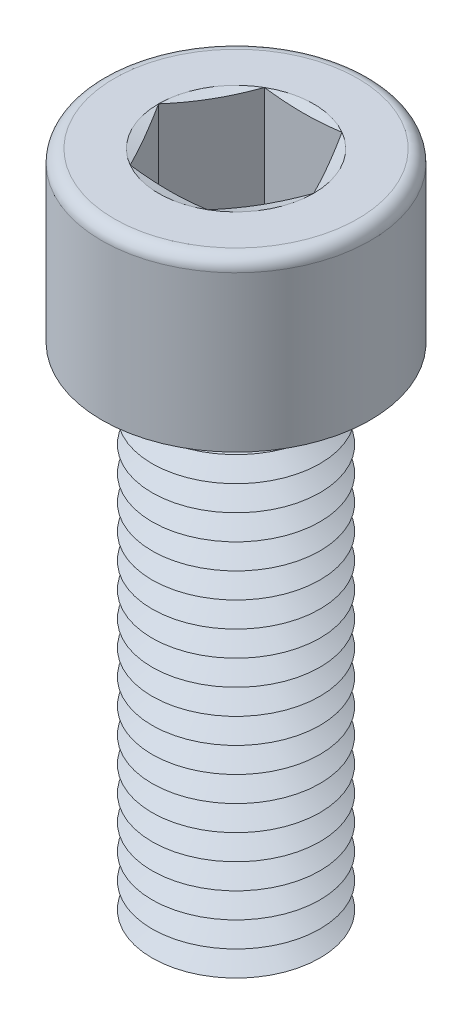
ISO-10303-21;
HEADER;
FILE_DESCRIPTION(('STEP AP214'),'2;1');
FILE_NAME('part.step','',(''),(''),'','','');
FILE_SCHEMA(('AUTOMOTIVE_DESIGN { 1 0 10303 214 1 1 1 1 }'));
ENDSEC;
DATA;
#1=APPLICATION_CONTEXT('core data for automotive mechanical design processes');
#2=APPLICATION_PROTOCOL_DEFINITION('international standard','automotive_design',2000,#1);
#3=PRODUCT_CONTEXT('',#1,'mechanical');
#4=PRODUCT('Part','Part','',(#3));
#5=PRODUCT_RELATED_PRODUCT_CATEGORY('part','',(#4));
#6=PRODUCT_DEFINITION_FORMATION('','',#4);
#7=PRODUCT_DEFINITION_CONTEXT('part definition',#1,'design');
#8=PRODUCT_DEFINITION('design','',#6,#7);
#9=PRODUCT_DEFINITION_SHAPE('','',#8);
#10=(LENGTH_UNIT() NAMED_UNIT(*) SI_UNIT(.MILLI.,.METRE.));
#11=(NAMED_UNIT(*) PLANE_ANGLE_UNIT() SI_UNIT($,.RADIAN.));
#12=(NAMED_UNIT(*) SI_UNIT($,.STERADIAN.) SOLID_ANGLE_UNIT());
#13=UNCERTAINTY_MEASURE_WITH_UNIT(LENGTH_MEASURE(1.E-05),#10,'distance_accuracy_value','');
#14=(GEOMETRIC_REPRESENTATION_CONTEXT(3) GLOBAL_UNCERTAINTY_ASSIGNED_CONTEXT((#13)) GLOBAL_UNIT_ASSIGNED_CONTEXT((#10,
#11,#12)) REPRESENTATION_CONTEXT('',''));
#15=CARTESIAN_POINT('',(0.,0.,0.));
#16=DIRECTION('',(0.,0.,1.));
#17=DIRECTION('',(1.,0.,0.));
#18=AXIS2_PLACEMENT_3D('',#15,#16,#17);
#19=CARTESIAN_POINT('',(0.,6.,0.));
#20=DIRECTION('',(0.,1.,0.));
#21=DIRECTION('',(0.,0.,1.));
#22=AXIS2_PLACEMENT_3D('',#19,#20,#21);
#23=CONICAL_SURFACE('',#22,3.70096189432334,1.0471975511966);
#24=CARTESIAN_POINT('',(0.,6.75,0.));
#25=DIRECTION('',(0.,1.,0.));
#26=DIRECTION('',(0.,0.,1.));
#27=AXIS2_PLACEMENT_3D('',#24,#25,#26);
#28=CIRCLE('',#27,5.);
#29=CARTESIAN_POINT('',(0.,6.75,5.));
#30=VERTEX_POINT('',#29);
#31=EDGE_CURVE('E470',#30,#30,#28,.T.);
#32=ORIENTED_EDGE('',*,*,#31,.F.);
#33=EDGE_LOOP('',(#32));
#34=FACE_BOUND('',#33,.T.);
#35=CARTESIAN_POINT('',(0.,6.,0.));
#36=DIRECTION('',(0.,1.,0.));
#37=DIRECTION('',(0.,0.,1.));
#38=AXIS2_PLACEMENT_3D('',#35,#36,#37);
#39=CIRCLE('',#38,3.70096189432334);
#40=CARTESIAN_POINT('',(0.,6.,3.70096189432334));
#41=VERTEX_POINT('',#40);
#42=EDGE_CURVE('E474',#41,#41,#39,.T.);
#43=ORIENTED_EDGE('',*,*,#42,.T.);
#44=EDGE_LOOP('',(#43));
#45=FACE_BOUND('',#44,.T.);
#46=ADVANCED_FACE('F41',(#34,#45),#23,.T.);
#47=CARTESIAN_POINT('',(0.,5.25,0.));
#48=DIRECTION('',(0.,-1.,0.));
#49=DIRECTION('',(0.,0.,-1.));
#50=AXIS2_PLACEMENT_3D('',#47,#48,#49);
#51=CONICAL_SURFACE('',#50,5.,1.0471975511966);
#52=ORIENTED_EDGE('',*,*,#42,.F.);
#53=EDGE_LOOP('',(#52));
#54=FACE_BOUND('',#53,.T.);
#55=CARTESIAN_POINT('',(0.,5.25,0.));
#56=DIRECTION('',(0.,1.,0.));
#57=DIRECTION('',(0.,0.,1.));
#58=AXIS2_PLACEMENT_3D('',#55,#56,#57);
#59=CIRCLE('',#58,5.);
#60=CARTESIAN_POINT('',(0.,5.25,5.));
#61=VERTEX_POINT('',#60);
#62=EDGE_CURVE('E478',#61,#61,#59,.T.);
#63=ORIENTED_EDGE('',*,*,#62,.T.);
#64=EDGE_LOOP('',(#63));
#65=FACE_BOUND('',#64,.T.);
#66=ADVANCED_FACE('F250',(#54,#65),#51,.T.);
#67=CARTESIAN_POINT('',(0.,0.,0.));
#68=DIRECTION('',(0.,1.,0.));
#69=DIRECTION('',(0.,0.,1.));
#70=AXIS2_PLACEMENT_3D('',#67,#68,#69);
#71=PLANE('',#70);
#72=CARTESIAN_POINT('',(0.,0.,0.));
#73=DIRECTION('',(0.,1.,0.));
#74=DIRECTION('',(0.,0.,1.));
#75=AXIS2_PLACEMENT_3D('',#72,#73,#74);
#76=CIRCLE('',#75,3.70096189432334);
#77=CARTESIAN_POINT('',(0.,0.,3.70096189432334));
#78=VERTEX_POINT('',#77);
#79=EDGE_CURVE('E505',#78,#78,#76,.T.);
#80=ORIENTED_EDGE('',*,*,#79,.F.);
#81=EDGE_LOOP('',(#80));
#82=FACE_BOUND('',#81,.T.);
#83=ADVANCED_FACE('F247',(#82),#71,.F.);
#84=CARTESIAN_POINT('',(0.,0.,0.));
#85=DIRECTION('',(0.,1.,0.));
#86=DIRECTION('',(0.,0.,1.));
#87=AXIS2_PLACEMENT_3D('',#84,#85,#86);
#88=CONICAL_SURFACE('',#87,3.70096189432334,1.0471975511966);
#89=CARTESIAN_POINT('',(0.,0.749999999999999,0.));
#90=DIRECTION('',(0.,1.,0.));
#91=DIRECTION('',(0.,0.,1.));
#92=AXIS2_PLACEMENT_3D('',#89,#90,#91);
#93=CIRCLE('',#92,5.);
#94=CARTESIAN_POINT('',(0.,0.749999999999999,5.));
#95=VERTEX_POINT('',#94);
#96=EDGE_CURVE('E501',#95,#95,#93,.T.);
#97=ORIENTED_EDGE('',*,*,#96,.F.);
#98=EDGE_LOOP('',(#97));
#99=FACE_BOUND('',#98,.T.);
#100=ORIENTED_EDGE('',*,*,#79,.T.);
#101=EDGE_LOOP('',(#100));
#102=FACE_BOUND('',#101,.T.);
#103=ADVANCED_FACE('F249',(#99,#102),#88,.T.);
#104=CARTESIAN_POINT('',(0.,0.749999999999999,0.));
#105=DIRECTION('',(0.,-1.,0.));
#106=DIRECTION('',(0.,0.,-1.));
#107=AXIS2_PLACEMENT_3D('',#104,#105,#106);
#108=CONICAL_SURFACE('',#107,5.,1.0471975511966);
#109=CARTESIAN_POINT('',(0.,1.5,0.));
#110=DIRECTION('',(0.,1.,0.));
#111=DIRECTION('',(0.,0.,1.));
#112=AXIS2_PLACEMENT_3D('',#109,#110,#111);
#113=CIRCLE('',#112,3.70096189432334);
#114=CARTESIAN_POINT('',(0.,1.5,3.70096189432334));
#115=VERTEX_POINT('',#114);
#116=EDGE_CURVE('E497',#115,#115,#113,.T.);
#117=ORIENTED_EDGE('',*,*,#116,.F.);
#118=EDGE_LOOP('',(#117));
#119=FACE_BOUND('',#118,.T.);
#120=ORIENTED_EDGE('',*,*,#96,.T.);
#121=EDGE_LOOP('',(#120));
#122=FACE_BOUND('',#121,.T.);
#123=ADVANCED_FACE('F290',(#119,#122),#108,.T.);
#124=CARTESIAN_POINT('',(0.,1.5,0.));
#125=DIRECTION('',(0.,1.,0.));
#126=DIRECTION('',(0.,0.,1.));
#127=AXIS2_PLACEMENT_3D('',#124,#125,#126);
#128=CONICAL_SURFACE('',#127,3.70096189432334,1.0471975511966);
#129=CARTESIAN_POINT('',(0.,2.25,0.));
#130=DIRECTION('',(0.,1.,0.));
#131=DIRECTION('',(0.,0.,1.));
#132=AXIS2_PLACEMENT_3D('',#129,#130,#131);
#133=CIRCLE('',#132,5.);
#134=CARTESIAN_POINT('',(0.,2.25,5.));
#135=VERTEX_POINT('',#134);
#136=EDGE_CURVE('E493',#135,#135,#133,.T.);
#137=ORIENTED_EDGE('',*,*,#136,.F.);
#138=EDGE_LOOP('',(#137));
#139=FACE_BOUND('',#138,.T.);
#140=ORIENTED_EDGE('',*,*,#116,.T.);
#141=EDGE_LOOP('',(#140));
#142=FACE_BOUND('',#141,.T.);
#143=ADVANCED_FACE('F285',(#139,#142),#128,.T.);
#144=CARTESIAN_POINT('',(0.,2.25,0.));
#145=DIRECTION('',(0.,-1.,0.));
#146=DIRECTION('',(0.,0.,-1.));
#147=AXIS2_PLACEMENT_3D('',#144,#145,#146);
#148=CONICAL_SURFACE('',#147,5.,1.0471975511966);
#149=CARTESIAN_POINT('',(0.,3.,0.));
#150=DIRECTION('',(0.,1.,0.));
#151=DIRECTION('',(0.,0.,1.));
#152=AXIS2_PLACEMENT_3D('',#149,#150,#151);
#153=CIRCLE('',#152,3.70096189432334);
#154=CARTESIAN_POINT('',(0.,3.,3.70096189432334));
#155=VERTEX_POINT('',#154);
#156=EDGE_CURVE('E489',#155,#155,#153,.T.);
#157=ORIENTED_EDGE('',*,*,#156,.F.);
#158=EDGE_LOOP('',(#157));
#159=FACE_BOUND('',#158,.T.);
#160=ORIENTED_EDGE('',*,*,#136,.T.);
#161=EDGE_LOOP('',(#160));
#162=FACE_BOUND('',#161,.T.);
#163=ADVANCED_FACE('F282',(#159,#162),#148,.T.);
#164=CARTESIAN_POINT('',(0.,3.,0.));
#165=DIRECTION('',(0.,1.,0.));
#166=DIRECTION('',(0.,0.,1.));
#167=AXIS2_PLACEMENT_3D('',#164,#165,#166);
#168=CONICAL_SURFACE('',#167,3.70096189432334,1.0471975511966);
#169=CARTESIAN_POINT('',(0.,3.75,0.));
#170=DIRECTION('',(0.,1.,0.));
#171=DIRECTION('',(0.,0.,1.));
#172=AXIS2_PLACEMENT_3D('',#169,#170,#171);
#173=CIRCLE('',#172,5.);
#174=CARTESIAN_POINT('',(0.,3.75,5.));
#175=VERTEX_POINT('',#174);
#176=EDGE_CURVE('E485',#175,#175,#173,.T.);
#177=ORIENTED_EDGE('',*,*,#176,.F.);
#178=EDGE_LOOP('',(#177));
#179=FACE_BOUND('',#178,.T.);
#180=ORIENTED_EDGE('',*,*,#156,.T.);
#181=EDGE_LOOP('',(#180));
#182=FACE_BOUND('',#181,.T.);
#183=ADVANCED_FACE('F276',(#179,#182),#168,.T.);
#184=CARTESIAN_POINT('',(0.,3.75,0.));
#185=DIRECTION('',(0.,-1.,0.));
#186=DIRECTION('',(0.,0.,-1.));
#187=AXIS2_PLACEMENT_3D('',#184,#185,#186);
#188=CONICAL_SURFACE('',#187,5.,1.0471975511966);
#189=CARTESIAN_POINT('',(0.,4.5,0.));
#190=DIRECTION('',(0.,1.,0.));
#191=DIRECTION('',(0.,0.,1.));
#192=AXIS2_PLACEMENT_3D('',#189,#190,#191);
#193=CIRCLE('',#192,3.70096189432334);
#194=CARTESIAN_POINT('',(0.,4.5,3.70096189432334));
#195=VERTEX_POINT('',#194);
#196=EDGE_CURVE('E481',#195,#195,#193,.T.);
#197=ORIENTED_EDGE('',*,*,#196,.F.);
#198=EDGE_LOOP('',(#197));
#199=FACE_BOUND('',#198,.T.);
#200=ORIENTED_EDGE('',*,*,#176,.T.);
#201=EDGE_LOOP('',(#200));
#202=FACE_BOUND('',#201,.T.);
#203=ADVANCED_FACE('F272',(#199,#202),#188,.T.);
#204=CARTESIAN_POINT('',(0.,4.5,0.));
#205=DIRECTION('',(0.,1.,0.));
#206=DIRECTION('',(0.,0.,1.));
#207=AXIS2_PLACEMENT_3D('',#204,#205,#206);
#208=CONICAL_SURFACE('',#207,3.70096189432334,1.0471975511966);
#209=ORIENTED_EDGE('',*,*,#62,.F.);
#210=EDGE_LOOP('',(#209));
#211=FACE_BOUND('',#210,.T.);
#212=ORIENTED_EDGE('',*,*,#196,.T.);
#213=EDGE_LOOP('',(#212));
#214=FACE_BOUND('',#213,.T.);
#215=ADVANCED_FACE('F275',(#211,#214),#208,.T.);
#216=CARTESIAN_POINT('',(0.,7.5,0.));
#217=DIRECTION('',(0.,1.,0.));
#218=DIRECTION('',(0.,0.,1.));
#219=AXIS2_PLACEMENT_3D('',#216,#217,#218);
#220=CONICAL_SURFACE('',#219,3.70096189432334,1.0471975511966);
#221=CARTESIAN_POINT('',(0.,8.25,0.));
#222=DIRECTION('',(0.,1.,0.));
#223=DIRECTION('',(0.,0.,1.));
#224=AXIS2_PLACEMENT_3D('',#221,#222,#223);
#225=CIRCLE('',#224,5.);
#226=CARTESIAN_POINT('',(0.,8.25,5.));
#227=VERTEX_POINT('',#226);
#228=EDGE_CURVE('E462',#227,#227,#225,.T.);
#229=ORIENTED_EDGE('',*,*,#228,.F.);
#230=EDGE_LOOP('',(#229));
#231=FACE_BOUND('',#230,.T.);
#232=CARTESIAN_POINT('',(0.,7.5,0.));
#233=DIRECTION('',(0.,1.,0.));
#234=DIRECTION('',(0.,0.,1.));
#235=AXIS2_PLACEMENT_3D('',#232,#233,#234);
#236=CIRCLE('',#235,3.70096189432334);
#237=CARTESIAN_POINT('',(0.,7.5,3.70096189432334));
#238=VERTEX_POINT('',#237);
#239=EDGE_CURVE('E466',#238,#238,#236,.T.);
#240=ORIENTED_EDGE('',*,*,#239,.T.);
#241=EDGE_LOOP('',(#240));
#242=FACE_BOUND('',#241,.T.);
#243=ADVANCED_FACE('F280',(#231,#242),#220,.T.);
#244=CARTESIAN_POINT('',(0.,6.75,0.));
#245=DIRECTION('',(0.,-1.,0.));
#246=DIRECTION('',(0.,0.,-1.));
#247=AXIS2_PLACEMENT_3D('',#244,#245,#246);
#248=CONICAL_SURFACE('',#247,5.,1.0471975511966);
#249=ORIENTED_EDGE('',*,*,#239,.F.);
#250=EDGE_LOOP('',(#249));
#251=FACE_BOUND('',#250,.T.);
#252=ORIENTED_EDGE('',*,*,#31,.T.);
#253=EDGE_LOOP('',(#252));
#254=FACE_BOUND('',#253,.T.);
#255=ADVANCED_FACE('F871',(#251,#254),#248,.T.);
#256=CARTESIAN_POINT('',(0.,9.,0.));
#257=DIRECTION('',(0.,1.,0.));
#258=DIRECTION('',(0.,0.,1.));
#259=AXIS2_PLACEMENT_3D('',#256,#257,#258);
#260=CONICAL_SURFACE('',#259,3.70096189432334,1.0471975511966);
#261=CARTESIAN_POINT('',(0.,9.75,0.));
#262=DIRECTION('',(0.,1.,0.));
#263=DIRECTION('',(0.,0.,1.));
#264=AXIS2_PLACEMENT_3D('',#261,#262,#263);
#265=CIRCLE('',#264,5.);
#266=CARTESIAN_POINT('',(0.,9.75,5.));
#267=VERTEX_POINT('',#266);
#268=EDGE_CURVE('E454',#267,#267,#265,.T.);
#269=ORIENTED_EDGE('',*,*,#268,.F.);
#270=EDGE_LOOP('',(#269));
#271=FACE_BOUND('',#270,.T.);
#272=CARTESIAN_POINT('',(0.,9.,0.));
#273=DIRECTION('',(0.,1.,0.));
#274=DIRECTION('',(0.,0.,1.));
#275=AXIS2_PLACEMENT_3D('',#272,#273,#274);
#276=CIRCLE('',#275,3.70096189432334);
#277=CARTESIAN_POINT('',(0.,9.,3.70096189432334));
#278=VERTEX_POINT('',#277);
#279=EDGE_CURVE('E458',#278,#278,#276,.T.);
#280=ORIENTED_EDGE('',*,*,#279,.T.);
#281=EDGE_LOOP('',(#280));
#282=FACE_BOUND('',#281,.T.);
#283=ADVANCED_FACE('F862',(#271,#282),#260,.T.);
#284=CARTESIAN_POINT('',(0.,8.25,0.));
#285=DIRECTION('',(0.,-1.,0.));
#286=DIRECTION('',(0.,0.,-1.));
#287=AXIS2_PLACEMENT_3D('',#284,#285,#286);
#288=CONICAL_SURFACE('',#287,5.,1.0471975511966);
#289=ORIENTED_EDGE('',*,*,#279,.F.);
#290=EDGE_LOOP('',(#289));
#291=FACE_BOUND('',#290,.T.);
#292=ORIENTED_EDGE('',*,*,#228,.T.);
#293=EDGE_LOOP('',(#292));
#294=FACE_BOUND('',#293,.T.);
#295=ADVANCED_FACE('F853',(#291,#294),#288,.T.);
#296=CARTESIAN_POINT('',(0.,10.5,0.));
#297=DIRECTION('',(0.,1.,0.));
#298=DIRECTION('',(0.,0.,1.));
#299=AXIS2_PLACEMENT_3D('',#296,#297,#298);
#300=CONICAL_SURFACE('',#299,3.70096189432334,1.0471975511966);
#301=CARTESIAN_POINT('',(0.,11.25,0.));
#302=DIRECTION('',(0.,1.,0.));
#303=DIRECTION('',(0.,0.,1.));
#304=AXIS2_PLACEMENT_3D('',#301,#302,#303);
#305=CIRCLE('',#304,5.);
#306=CARTESIAN_POINT('',(0.,11.25,5.));
#307=VERTEX_POINT('',#306);
#308=EDGE_CURVE('E446',#307,#307,#305,.T.);
#309=ORIENTED_EDGE('',*,*,#308,.F.);
#310=EDGE_LOOP('',(#309));
#311=FACE_BOUND('',#310,.T.);
#312=CARTESIAN_POINT('',(0.,10.5,0.));
#313=DIRECTION('',(0.,1.,0.));
#314=DIRECTION('',(0.,0.,1.));
#315=AXIS2_PLACEMENT_3D('',#312,#313,#314);
#316=CIRCLE('',#315,3.70096189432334);
#317=CARTESIAN_POINT('',(0.,10.5,3.70096189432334));
#318=VERTEX_POINT('',#317);
#319=EDGE_CURVE('E450',#318,#318,#316,.T.);
#320=ORIENTED_EDGE('',*,*,#319,.T.);
#321=EDGE_LOOP('',(#320));
#322=FACE_BOUND('',#321,.T.);
#323=ADVANCED_FACE('F844',(#311,#322),#300,.T.);
#324=CARTESIAN_POINT('',(0.,9.75,0.));
#325=DIRECTION('',(0.,-1.,0.));
#326=DIRECTION('',(0.,0.,-1.));
#327=AXIS2_PLACEMENT_3D('',#324,#325,#326);
#328=CONICAL_SURFACE('',#327,5.,1.0471975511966);
#329=ORIENTED_EDGE('',*,*,#319,.F.);
#330=EDGE_LOOP('',(#329));
#331=FACE_BOUND('',#330,.T.);
#332=ORIENTED_EDGE('',*,*,#268,.T.);
#333=EDGE_LOOP('',(#332));
#334=FACE_BOUND('',#333,.T.);
#335=ADVANCED_FACE('F835',(#331,#334),#328,.T.);
#336=CARTESIAN_POINT('',(0.,12.,0.));
#337=DIRECTION('',(0.,1.,0.));
#338=DIRECTION('',(0.,0.,1.));
#339=AXIS2_PLACEMENT_3D('',#336,#337,#338);
#340=CONICAL_SURFACE('',#339,3.70096189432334,1.0471975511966);
#341=CARTESIAN_POINT('',(0.,12.75,0.));
#342=DIRECTION('',(0.,1.,0.));
#343=DIRECTION('',(0.,0.,1.));
#344=AXIS2_PLACEMENT_3D('',#341,#342,#343);
#345=CIRCLE('',#344,5.);
#346=CARTESIAN_POINT('',(0.,12.75,5.));
#347=VERTEX_POINT('',#346);
#348=EDGE_CURVE('E438',#347,#347,#345,.T.);
#349=ORIENTED_EDGE('',*,*,#348,.F.);
#350=EDGE_LOOP('',(#349));
#351=FACE_BOUND('',#350,.T.);
#352=CARTESIAN_POINT('',(0.,12.,0.));
#353=DIRECTION('',(0.,1.,0.));
#354=DIRECTION('',(0.,0.,1.));
#355=AXIS2_PLACEMENT_3D('',#352,#353,#354);
#356=CIRCLE('',#355,3.70096189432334);
#357=CARTESIAN_POINT('',(0.,12.,3.70096189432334));
#358=VERTEX_POINT('',#357);
#359=EDGE_CURVE('E442',#358,#358,#356,.T.);
#360=ORIENTED_EDGE('',*,*,#359,.T.);
#361=EDGE_LOOP('',(#360));
#362=FACE_BOUND('',#361,.T.);
#363=ADVANCED_FACE('F826',(#351,#362),#340,.T.);
#364=CARTESIAN_POINT('',(0.,11.25,0.));
#365=DIRECTION('',(0.,-1.,0.));
#366=DIRECTION('',(0.,0.,-1.));
#367=AXIS2_PLACEMENT_3D('',#364,#365,#366);
#368=CONICAL_SURFACE('',#367,5.,1.0471975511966);
#369=ORIENTED_EDGE('',*,*,#359,.F.);
#370=EDGE_LOOP('',(#369));
#371=FACE_BOUND('',#370,.T.);
#372=ORIENTED_EDGE('',*,*,#308,.T.);
#373=EDGE_LOOP('',(#372));
#374=FACE_BOUND('',#373,.T.);
#375=ADVANCED_FACE('F817',(#371,#374),#368,.T.);
#376=CARTESIAN_POINT('',(0.,13.5,0.));
#377=DIRECTION('',(0.,1.,0.));
#378=DIRECTION('',(0.,0.,1.));
#379=AXIS2_PLACEMENT_3D('',#376,#377,#378);
#380=CONICAL_SURFACE('',#379,3.70096189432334,1.0471975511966);
#381=CARTESIAN_POINT('',(0.,14.25,0.));
#382=DIRECTION('',(0.,1.,0.));
#383=DIRECTION('',(0.,0.,1.));
#384=AXIS2_PLACEMENT_3D('',#381,#382,#383);
#385=CIRCLE('',#384,5.);
#386=CARTESIAN_POINT('',(0.,14.25,5.));
#387=VERTEX_POINT('',#386);
#388=EDGE_CURVE('E431',#387,#387,#385,.T.);
#389=ORIENTED_EDGE('',*,*,#388,.F.);
#390=EDGE_LOOP('',(#389));
#391=FACE_BOUND('',#390,.T.);
#392=CARTESIAN_POINT('',(0.,13.5,0.));
#393=DIRECTION('',(0.,1.,0.));
#394=DIRECTION('',(0.,0.,1.));
#395=AXIS2_PLACEMENT_3D('',#392,#393,#394);
#396=CIRCLE('',#395,3.70096189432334);
#397=CARTESIAN_POINT('',(0.,13.5,3.70096189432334));
#398=VERTEX_POINT('',#397);
#399=EDGE_CURVE('E434',#398,#398,#396,.T.);
#400=ORIENTED_EDGE('',*,*,#399,.T.);
#401=EDGE_LOOP('',(#400));
#402=FACE_BOUND('',#401,.T.);
#403=ADVANCED_FACE('F808',(#391,#402),#380,.T.);
#404=CARTESIAN_POINT('',(0.,12.75,0.));
#405=DIRECTION('',(0.,-1.,0.));
#406=DIRECTION('',(0.,0.,-1.));
#407=AXIS2_PLACEMENT_3D('',#404,#405,#406);
#408=CONICAL_SURFACE('',#407,5.,1.0471975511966);
#409=ORIENTED_EDGE('',*,*,#399,.F.);
#410=EDGE_LOOP('',(#409));
#411=FACE_BOUND('',#410,.T.);
#412=ORIENTED_EDGE('',*,*,#348,.T.);
#413=EDGE_LOOP('',(#412));
#414=FACE_BOUND('',#413,.T.);
#415=ADVANCED_FACE('F799',(#411,#414),#408,.T.);
#416=CARTESIAN_POINT('',(0.,15.,0.));
#417=DIRECTION('',(0.,1.,0.));
#418=DIRECTION('',(0.,0.,1.));
#419=AXIS2_PLACEMENT_3D('',#416,#417,#418);
#420=CONICAL_SURFACE('',#419,3.70096189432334,1.0471975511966);
#421=CARTESIAN_POINT('',(0.,15.75,0.));
#422=DIRECTION('',(0.,1.,0.));
#423=DIRECTION('',(0.,0.,1.));
#424=AXIS2_PLACEMENT_3D('',#421,#422,#423);
#425=CIRCLE('',#424,5.);
#426=CARTESIAN_POINT('',(0.,15.75,5.));
#427=VERTEX_POINT('',#426);
#428=EDGE_CURVE('E423',#427,#427,#425,.T.);
#429=ORIENTED_EDGE('',*,*,#428,.F.);
#430=EDGE_LOOP('',(#429));
#431=FACE_BOUND('',#430,.T.);
#432=CARTESIAN_POINT('',(0.,15.,0.));
#433=DIRECTION('',(0.,1.,0.));
#434=DIRECTION('',(0.,0.,1.));
#435=AXIS2_PLACEMENT_3D('',#432,#433,#434);
#436=CIRCLE('',#435,3.70096189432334);
#437=CARTESIAN_POINT('',(0.,15.,3.70096189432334));
#438=VERTEX_POINT('',#437);
#439=EDGE_CURVE('E427',#438,#438,#436,.T.);
#440=ORIENTED_EDGE('',*,*,#439,.T.);
#441=EDGE_LOOP('',(#440));
#442=FACE_BOUND('',#441,.T.);
#443=ADVANCED_FACE('F790',(#431,#442),#420,.T.);
#444=CARTESIAN_POINT('',(0.,14.25,0.));
#445=DIRECTION('',(0.,-1.,0.));
#446=DIRECTION('',(0.,0.,-1.));
#447=AXIS2_PLACEMENT_3D('',#444,#445,#446);
#448=CONICAL_SURFACE('',#447,5.,1.0471975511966);
#449=ORIENTED_EDGE('',*,*,#439,.F.);
#450=EDGE_LOOP('',(#449));
#451=FACE_BOUND('',#450,.T.);
#452=ORIENTED_EDGE('',*,*,#388,.T.);
#453=EDGE_LOOP('',(#452));
#454=FACE_BOUND('',#453,.T.);
#455=ADVANCED_FACE('F781',(#451,#454),#448,.T.);
#456=CARTESIAN_POINT('',(0.,16.5,0.));
#457=DIRECTION('',(0.,1.,0.));
#458=DIRECTION('',(0.,0.,1.));
#459=AXIS2_PLACEMENT_3D('',#456,#457,#458);
#460=CONICAL_SURFACE('',#459,3.70096189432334,1.0471975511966);
#461=CARTESIAN_POINT('',(0.,17.25,0.));
#462=DIRECTION('',(0.,1.,0.));
#463=DIRECTION('',(0.,0.,1.));
#464=AXIS2_PLACEMENT_3D('',#461,#462,#463);
#465=CIRCLE('',#464,5.);
#466=CARTESIAN_POINT('',(0.,17.25,5.));
#467=VERTEX_POINT('',#466);
#468=EDGE_CURVE('E415',#467,#467,#465,.T.);
#469=ORIENTED_EDGE('',*,*,#468,.F.);
#470=EDGE_LOOP('',(#469));
#471=FACE_BOUND('',#470,.T.);
#472=CARTESIAN_POINT('',(0.,16.5,0.));
#473=DIRECTION('',(0.,1.,0.));
#474=DIRECTION('',(0.,0.,1.));
#475=AXIS2_PLACEMENT_3D('',#472,#473,#474);
#476=CIRCLE('',#475,3.70096189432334);
#477=CARTESIAN_POINT('',(0.,16.5,3.70096189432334));
#478=VERTEX_POINT('',#477);
#479=EDGE_CURVE('E419',#478,#478,#476,.T.);
#480=ORIENTED_EDGE('',*,*,#479,.T.);
#481=EDGE_LOOP('',(#480));
#482=FACE_BOUND('',#481,.T.);
#483=ADVANCED_FACE('F772',(#471,#482),#460,.T.);
#484=CARTESIAN_POINT('',(0.,15.75,0.));
#485=DIRECTION('',(0.,-1.,0.));
#486=DIRECTION('',(0.,0.,-1.));
#487=AXIS2_PLACEMENT_3D('',#484,#485,#486);
#488=CONICAL_SURFACE('',#487,5.,1.0471975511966);
#489=ORIENTED_EDGE('',*,*,#479,.F.);
#490=EDGE_LOOP('',(#489));
#491=FACE_BOUND('',#490,.T.);
#492=ORIENTED_EDGE('',*,*,#428,.T.);
#493=EDGE_LOOP('',(#492));
#494=FACE_BOUND('',#493,.T.);
#495=ADVANCED_FACE('F763',(#491,#494),#488,.T.);
#496=CARTESIAN_POINT('',(0.,18.,0.));
#497=DIRECTION('',(0.,1.,0.));
#498=DIRECTION('',(0.,0.,1.));
#499=AXIS2_PLACEMENT_3D('',#496,#497,#498);
#500=CONICAL_SURFACE('',#499,3.70096189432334,1.0471975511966);
#501=CARTESIAN_POINT('',(0.,18.75,0.));
#502=DIRECTION('',(0.,1.,0.));
#503=DIRECTION('',(0.,0.,1.));
#504=AXIS2_PLACEMENT_3D('',#501,#502,#503);
#505=CIRCLE('',#504,5.);
#506=CARTESIAN_POINT('',(0.,18.75,5.));
#507=VERTEX_POINT('',#506);
#508=EDGE_CURVE('E407',#507,#507,#505,.T.);
#509=ORIENTED_EDGE('',*,*,#508,.F.);
#510=EDGE_LOOP('',(#509));
#511=FACE_BOUND('',#510,.T.);
#512=CARTESIAN_POINT('',(0.,18.,0.));
#513=DIRECTION('',(0.,1.,0.));
#514=DIRECTION('',(0.,0.,1.));
#515=AXIS2_PLACEMENT_3D('',#512,#513,#514);
#516=CIRCLE('',#515,3.70096189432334);
#517=CARTESIAN_POINT('',(0.,18.,3.70096189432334));
#518=VERTEX_POINT('',#517);
#519=EDGE_CURVE('E411',#518,#518,#516,.T.);
#520=ORIENTED_EDGE('',*,*,#519,.T.);
#521=EDGE_LOOP('',(#520));
#522=FACE_BOUND('',#521,.T.);
#523=ADVANCED_FACE('F754',(#511,#522),#500,.T.);
#524=CARTESIAN_POINT('',(0.,17.25,0.));
#525=DIRECTION('',(0.,-1.,0.));
#526=DIRECTION('',(0.,0.,-1.));
#527=AXIS2_PLACEMENT_3D('',#524,#525,#526);
#528=CONICAL_SURFACE('',#527,5.,1.0471975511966);
#529=ORIENTED_EDGE('',*,*,#519,.F.);
#530=EDGE_LOOP('',(#529));
#531=FACE_BOUND('',#530,.T.);
#532=ORIENTED_EDGE('',*,*,#468,.T.);
#533=EDGE_LOOP('',(#532));
#534=FACE_BOUND('',#533,.T.);
#535=ADVANCED_FACE('F745',(#531,#534),#528,.T.);
#536=CARTESIAN_POINT('',(0.,19.5,0.));
#537=DIRECTION('',(0.,1.,0.));
#538=DIRECTION('',(0.,0.,1.));
#539=AXIS2_PLACEMENT_3D('',#536,#537,#538);
#540=CONICAL_SURFACE('',#539,3.70096189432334,1.0471975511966);
#541=CARTESIAN_POINT('',(0.,20.25,0.));
#542=DIRECTION('',(0.,1.,0.));
#543=DIRECTION('',(0.,0.,1.));
#544=AXIS2_PLACEMENT_3D('',#541,#542,#543);
#545=CIRCLE('',#544,5.);
#546=CARTESIAN_POINT('',(0.,20.25,5.));
#547=VERTEX_POINT('',#546);
#548=EDGE_CURVE('E399',#547,#547,#545,.T.);
#549=ORIENTED_EDGE('',*,*,#548,.F.);
#550=EDGE_LOOP('',(#549));
#551=FACE_BOUND('',#550,.T.);
#552=CARTESIAN_POINT('',(0.,19.5,0.));
#553=DIRECTION('',(0.,1.,0.));
#554=DIRECTION('',(0.,0.,1.));
#555=AXIS2_PLACEMENT_3D('',#552,#553,#554);
#556=CIRCLE('',#555,3.70096189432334);
#557=CARTESIAN_POINT('',(0.,19.5,3.70096189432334));
#558=VERTEX_POINT('',#557);
#559=EDGE_CURVE('E403',#558,#558,#556,.T.);
#560=ORIENTED_EDGE('',*,*,#559,.T.);
#561=EDGE_LOOP('',(#560));
#562=FACE_BOUND('',#561,.T.);
#563=ADVANCED_FACE('F736',(#551,#562),#540,.T.);
#564=CARTESIAN_POINT('',(0.,18.75,0.));
#565=DIRECTION('',(0.,-1.,0.));
#566=DIRECTION('',(0.,0.,-1.));
#567=AXIS2_PLACEMENT_3D('',#564,#565,#566);
#568=CONICAL_SURFACE('',#567,5.,1.0471975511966);
#569=ORIENTED_EDGE('',*,*,#559,.F.);
#570=EDGE_LOOP('',(#569));
#571=FACE_BOUND('',#570,.T.);
#572=ORIENTED_EDGE('',*,*,#508,.T.);
#573=EDGE_LOOP('',(#572));
#574=FACE_BOUND('',#573,.T.);
#575=ADVANCED_FACE('F727',(#571,#574),#568,.T.);
#576=CARTESIAN_POINT('',(0.,21.,0.));
#577=DIRECTION('',(0.,1.,0.));
#578=DIRECTION('',(0.,0.,1.));
#579=AXIS2_PLACEMENT_3D('',#576,#577,#578);
#580=CONICAL_SURFACE('',#579,3.70096189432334,1.0471975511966);
#581=CARTESIAN_POINT('',(0.,21.75,0.));
#582=DIRECTION('',(0.,1.,0.));
#583=DIRECTION('',(0.,0.,1.));
#584=AXIS2_PLACEMENT_3D('',#581,#582,#583);
#585=CIRCLE('',#584,5.);
#586=CARTESIAN_POINT('',(0.,21.75,5.));
#587=VERTEX_POINT('',#586);
#588=EDGE_CURVE('E391',#587,#587,#585,.T.);
#589=ORIENTED_EDGE('',*,*,#588,.F.);
#590=EDGE_LOOP('',(#589));
#591=FACE_BOUND('',#590,.T.);
#592=CARTESIAN_POINT('',(0.,21.,0.));
#593=DIRECTION('',(0.,1.,0.));
#594=DIRECTION('',(0.,0.,1.));
#595=AXIS2_PLACEMENT_3D('',#592,#593,#594);
#596=CIRCLE('',#595,3.70096189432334);
#597=CARTESIAN_POINT('',(0.,21.,3.70096189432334));
#598=VERTEX_POINT('',#597);
#599=EDGE_CURVE('E395',#598,#598,#596,.T.);
#600=ORIENTED_EDGE('',*,*,#599,.T.);
#601=EDGE_LOOP('',(#600));
#602=FACE_BOUND('',#601,.T.);
#603=ADVANCED_FACE('F718',(#591,#602),#580,.T.);
#604=CARTESIAN_POINT('',(0.,20.25,0.));
#605=DIRECTION('',(0.,-1.,0.));
#606=DIRECTION('',(0.,0.,-1.));
#607=AXIS2_PLACEMENT_3D('',#604,#605,#606);
#608=CONICAL_SURFACE('',#607,5.,1.0471975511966);
#609=ORIENTED_EDGE('',*,*,#599,.F.);
#610=EDGE_LOOP('',(#609));
#611=FACE_BOUND('',#610,.T.);
#612=ORIENTED_EDGE('',*,*,#548,.T.);
#613=EDGE_LOOP('',(#612));
#614=FACE_BOUND('',#613,.T.);
#615=ADVANCED_FACE('F709',(#611,#614),#608,.T.);
#616=CARTESIAN_POINT('',(0.,22.5,0.));
#617=DIRECTION('',(0.,1.,0.));
#618=DIRECTION('',(0.,0.,1.));
#619=AXIS2_PLACEMENT_3D('',#616,#617,#618);
#620=CONICAL_SURFACE('',#619,3.70096189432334,1.0471975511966);
#621=CARTESIAN_POINT('',(0.,23.25,0.));
#622=DIRECTION('',(0.,1.,0.));
#623=DIRECTION('',(0.,0.,1.));
#624=AXIS2_PLACEMENT_3D('',#621,#622,#623);
#625=CIRCLE('',#624,5.);
#626=CARTESIAN_POINT('',(0.,23.25,5.));
#627=VERTEX_POINT('',#626);
#628=EDGE_CURVE('E383',#627,#627,#625,.T.);
#629=ORIENTED_EDGE('',*,*,#628,.F.);
#630=EDGE_LOOP('',(#629));
#631=FACE_BOUND('',#630,.T.);
#632=CARTESIAN_POINT('',(0.,22.5,0.));
#633=DIRECTION('',(0.,1.,0.));
#634=DIRECTION('',(0.,0.,1.));
#635=AXIS2_PLACEMENT_3D('',#632,#633,#634);
#636=CIRCLE('',#635,3.70096189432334);
#637=CARTESIAN_POINT('',(0.,22.5,3.70096189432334));
#638=VERTEX_POINT('',#637);
#639=EDGE_CURVE('E387',#638,#638,#636,.T.);
#640=ORIENTED_EDGE('',*,*,#639,.T.);
#641=EDGE_LOOP('',(#640));
#642=FACE_BOUND('',#641,.T.);
#643=ADVANCED_FACE('F700',(#631,#642),#620,.T.);
#644=CARTESIAN_POINT('',(0.,21.75,0.));
#645=DIRECTION('',(0.,-1.,0.));
#646=DIRECTION('',(0.,0.,-1.));
#647=AXIS2_PLACEMENT_3D('',#644,#645,#646);
#648=CONICAL_SURFACE('',#647,5.,1.0471975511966);
#649=ORIENTED_EDGE('',*,*,#639,.F.);
#650=EDGE_LOOP('',(#649));
#651=FACE_BOUND('',#650,.T.);
#652=ORIENTED_EDGE('',*,*,#588,.T.);
#653=EDGE_LOOP('',(#652));
#654=FACE_BOUND('',#653,.T.);
#655=ADVANCED_FACE('F691',(#651,#654),#648,.T.);
#656=CARTESIAN_POINT('',(0.,24.,0.));
#657=DIRECTION('',(0.,1.,0.));
#658=DIRECTION('',(0.,0.,1.));
#659=AXIS2_PLACEMENT_3D('',#656,#657,#658);
#660=CONICAL_SURFACE('',#659,3.70096189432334,1.0471975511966);
#661=CARTESIAN_POINT('',(0.,24.75,0.));
#662=DIRECTION('',(0.,1.,0.));
#663=DIRECTION('',(0.,0.,1.));
#664=AXIS2_PLACEMENT_3D('',#661,#662,#663);
#665=CIRCLE('',#664,5.);
#666=CARTESIAN_POINT('',(0.,24.75,5.));
#667=VERTEX_POINT('',#666);
#668=EDGE_CURVE('E375',#667,#667,#665,.T.);
#669=ORIENTED_EDGE('',*,*,#668,.F.);
#670=EDGE_LOOP('',(#669));
#671=FACE_BOUND('',#670,.T.);
#672=CARTESIAN_POINT('',(0.,24.,0.));
#673=DIRECTION('',(0.,1.,0.));
#674=DIRECTION('',(0.,0.,1.));
#675=AXIS2_PLACEMENT_3D('',#672,#673,#674);
#676=CIRCLE('',#675,3.70096189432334);
#677=CARTESIAN_POINT('',(0.,24.,3.70096189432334));
#678=VERTEX_POINT('',#677);
#679=EDGE_CURVE('E379',#678,#678,#676,.T.);
#680=ORIENTED_EDGE('',*,*,#679,.T.);
#681=EDGE_LOOP('',(#680));
#682=FACE_BOUND('',#681,.T.);
#683=ADVANCED_FACE('F682',(#671,#682),#660,.T.);
#684=CARTESIAN_POINT('',(0.,23.25,0.));
#685=DIRECTION('',(0.,-1.,0.));
#686=DIRECTION('',(0.,0.,-1.));
#687=AXIS2_PLACEMENT_3D('',#684,#685,#686);
#688=CONICAL_SURFACE('',#687,5.,1.0471975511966);
#689=ORIENTED_EDGE('',*,*,#679,.F.);
#690=EDGE_LOOP('',(#689));
#691=FACE_BOUND('',#690,.T.);
#692=ORIENTED_EDGE('',*,*,#628,.T.);
#693=EDGE_LOOP('',(#692));
#694=FACE_BOUND('',#693,.T.);
#695=ADVANCED_FACE('F673',(#691,#694),#688,.T.);
#696=CARTESIAN_POINT('',(0.,25.5,0.));
#697=DIRECTION('',(0.,1.,0.));
#698=DIRECTION('',(0.,0.,1.));
#699=AXIS2_PLACEMENT_3D('',#696,#697,#698);
#700=CONICAL_SURFACE('',#699,3.70096189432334,1.0471975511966);
#701=CARTESIAN_POINT('',(0.,26.25,0.));
#702=DIRECTION('',(0.,1.,0.));
#703=DIRECTION('',(0.,0.,1.));
#704=AXIS2_PLACEMENT_3D('',#701,#702,#703);
#705=CIRCLE('',#704,5.);
#706=CARTESIAN_POINT('',(0.,26.25,5.));
#707=VERTEX_POINT('',#706);
#708=EDGE_CURVE('E367',#707,#707,#705,.T.);
#709=ORIENTED_EDGE('',*,*,#708,.F.);
#710=EDGE_LOOP('',(#709));
#711=FACE_BOUND('',#710,.T.);
#712=CARTESIAN_POINT('',(0.,25.5,0.));
#713=DIRECTION('',(0.,1.,0.));
#714=DIRECTION('',(0.,0.,1.));
#715=AXIS2_PLACEMENT_3D('',#712,#713,#714);
#716=CIRCLE('',#715,3.70096189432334);
#717=CARTESIAN_POINT('',(0.,25.5,3.70096189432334));
#718=VERTEX_POINT('',#717);
#719=EDGE_CURVE('E371',#718,#718,#716,.T.);
#720=ORIENTED_EDGE('',*,*,#719,.T.);
#721=EDGE_LOOP('',(#720));
#722=FACE_BOUND('',#721,.T.);
#723=ADVANCED_FACE('F664',(#711,#722),#700,.T.);
#724=CARTESIAN_POINT('',(0.,24.75,0.));
#725=DIRECTION('',(0.,-1.,0.));
#726=DIRECTION('',(0.,0.,-1.));
#727=AXIS2_PLACEMENT_3D('',#724,#725,#726);
#728=CONICAL_SURFACE('',#727,5.,1.0471975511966);
#729=ORIENTED_EDGE('',*,*,#719,.F.);
#730=EDGE_LOOP('',(#729));
#731=FACE_BOUND('',#730,.T.);
#732=ORIENTED_EDGE('',*,*,#668,.T.);
#733=EDGE_LOOP('',(#732));
#734=FACE_BOUND('',#733,.T.);
#735=ADVANCED_FACE('F655',(#731,#734),#728,.T.);
#736=CARTESIAN_POINT('',(0.,27.,0.));
#737=DIRECTION('',(0.,1.,0.));
#738=DIRECTION('',(0.,0.,1.));
#739=AXIS2_PLACEMENT_3D('',#736,#737,#738);
#740=CONICAL_SURFACE('',#739,3.70096189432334,1.0471975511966);
#741=CARTESIAN_POINT('',(0.,27.75,0.));
#742=DIRECTION('',(0.,1.,0.));
#743=DIRECTION('',(0.,0.,1.));
#744=AXIS2_PLACEMENT_3D('',#741,#742,#743);
#745=CIRCLE('',#744,5.);
#746=CARTESIAN_POINT('',(0.,27.75,5.));
#747=VERTEX_POINT('',#746);
#748=EDGE_CURVE('E352',#747,#747,#745,.T.);
#749=ORIENTED_EDGE('',*,*,#748,.F.);
#750=EDGE_LOOP('',(#749));
#751=FACE_BOUND('',#750,.T.);
#752=CARTESIAN_POINT('',(0.,27.,0.));
#753=DIRECTION('',(0.,1.,0.));
#754=DIRECTION('',(0.,0.,1.));
#755=AXIS2_PLACEMENT_3D('',#752,#753,#754);
#756=CIRCLE('',#755,3.70096189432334);
#757=CARTESIAN_POINT('',(0.,27.,3.70096189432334));
#758=VERTEX_POINT('',#757);
#759=EDGE_CURVE('E364',#758,#758,#756,.T.);
#760=ORIENTED_EDGE('',*,*,#759,.T.);
#761=EDGE_LOOP('',(#760));
#762=FACE_BOUND('',#761,.T.);
#763=ADVANCED_FACE('F646',(#751,#762),#740,.T.);
#764=CARTESIAN_POINT('',(0.,26.25,0.));
#765=DIRECTION('',(0.,-1.,0.));
#766=DIRECTION('',(0.,0.,-1.));
#767=AXIS2_PLACEMENT_3D('',#764,#765,#766);
#768=CONICAL_SURFACE('',#767,5.,1.0471975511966);
#769=ORIENTED_EDGE('',*,*,#759,.F.);
#770=EDGE_LOOP('',(#769));
#771=FACE_BOUND('',#770,.T.);
#772=ORIENTED_EDGE('',*,*,#708,.T.);
#773=EDGE_LOOP('',(#772));
#774=FACE_BOUND('',#773,.T.);
#775=ADVANCED_FACE('F638',(#771,#774),#768,.T.);
#776=CARTESIAN_POINT('',(0.,28.5,0.));
#777=DIRECTION('',(0.,1.,0.));
#778=DIRECTION('',(0.,0.,1.));
#779=AXIS2_PLACEMENT_3D('',#776,#777,#778);
#780=CONICAL_SURFACE('',#779,3.70096189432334,1.0471975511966);
#781=CARTESIAN_POINT('',(0.,29.25,0.));
#782=DIRECTION('',(0.,1.,0.));
#783=DIRECTION('',(0.,0.,1.));
#784=AXIS2_PLACEMENT_3D('',#781,#782,#783);
#785=CIRCLE('',#784,5.);
#786=CARTESIAN_POINT('',(0.,29.25,5.));
#787=VERTEX_POINT('',#786);
#788=EDGE_CURVE('E359',#787,#787,#785,.T.);
#789=ORIENTED_EDGE('',*,*,#788,.F.);
#790=EDGE_LOOP('',(#789));
#791=FACE_BOUND('',#790,.T.);
#792=CARTESIAN_POINT('',(0.,28.5,0.));
#793=DIRECTION('',(0.,1.,0.));
#794=DIRECTION('',(0.,0.,1.));
#795=AXIS2_PLACEMENT_3D('',#792,#793,#794);
#796=CIRCLE('',#795,3.70096189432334);
#797=CARTESIAN_POINT('',(0.,28.5,3.70096189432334));
#798=VERTEX_POINT('',#797);
#799=EDGE_CURVE('E347',#798,#798,#796,.T.);
#800=ORIENTED_EDGE('',*,*,#799,.T.);
#801=EDGE_LOOP('',(#800));
#802=FACE_BOUND('',#801,.T.);
#803=ADVANCED_FACE('F630',(#791,#802),#780,.T.);
#804=CARTESIAN_POINT('',(0.,27.75,0.));
#805=DIRECTION('',(0.,-1.,0.));
#806=DIRECTION('',(0.,0.,-1.));
#807=AXIS2_PLACEMENT_3D('',#804,#805,#806);
#808=CONICAL_SURFACE('',#807,5.,1.0471975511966);
#809=ORIENTED_EDGE('',*,*,#799,.F.);
#810=EDGE_LOOP('',(#809));
#811=FACE_BOUND('',#810,.T.);
#812=ORIENTED_EDGE('',*,*,#748,.T.);
#813=EDGE_LOOP('',(#812));
#814=FACE_BOUND('',#813,.T.);
#815=ADVANCED_FACE('F194',(#811,#814),#808,.T.);
#816=CARTESIAN_POINT('',(0.,40.,0.));
#817=DIRECTION('',(0.,1.,0.));
#818=DIRECTION('',(0.,0.,1.));
#819=AXIS2_PLACEMENT_3D('',#816,#817,#818);
#820=PLANE('',#819);
#821=CARTESIAN_POINT('',(0.,40.,0.));
#822=DIRECTION('',(0.,1.,0.));
#823=DIRECTION('',(0.,0.,1.));
#824=AXIS2_PLACEMENT_3D('',#821,#822,#823);
#825=CIRCLE('',#824,4.61880215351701);
#826=CARTESIAN_POINT('',(2.3094010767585,40.,4.));
#827=VERTEX_POINT('',#826);
#828=CARTESIAN_POINT('',(4.61880215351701,40.,0.));
#829=VERTEX_POINT('',#828);
#830=EDGE_CURVE('E121',#827,#829,#825,.T.);
#831=ORIENTED_EDGE('',*,*,#830,.F.);
#832=CARTESIAN_POINT('',(0.,40.,0.));
#833=DIRECTION('',(0.,1.,0.));
#834=DIRECTION('',(0.,0.,1.));
#835=AXIS2_PLACEMENT_3D('',#832,#833,#834);
#836=CIRCLE('',#835,4.61880215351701);
#837=CARTESIAN_POINT('',(-2.3094010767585,40.,4.));
#838=VERTEX_POINT('',#837);
#839=EDGE_CURVE('E45',#838,#827,#836,.T.);
#840=ORIENTED_EDGE('',*,*,#839,.F.);
#841=CARTESIAN_POINT('',(-4.61880215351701,40.,0.));
#842=VERTEX_POINT('',#841);
#843=EDGE_CURVE('E138',#842,#838,#836,.T.);
#844=ORIENTED_EDGE('',*,*,#843,.F.);
#845=CARTESIAN_POINT('',(-2.3094010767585,40.,-4.));
#846=VERTEX_POINT('',#845);
#847=EDGE_CURVE('E584',#846,#842,#836,.T.);
#848=ORIENTED_EDGE('',*,*,#847,.F.);
#849=CARTESIAN_POINT('',(2.3094010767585,40.,-4.));
#850=VERTEX_POINT('',#849);
#851=EDGE_CURVE('E51',#850,#846,#836,.T.);
#852=ORIENTED_EDGE('',*,*,#851,.F.);
#853=EDGE_CURVE('E11',#829,#850,#836,.T.);
#854=ORIENTED_EDGE('',*,*,#853,.F.);
#855=EDGE_LOOP('',(#831,#840,#844,#848,#852,#854));
#856=FACE_BOUND('',#855,.T.);
#857=CARTESIAN_POINT('',(0.,40.,0.));
#858=DIRECTION('',(0.,1.,0.));
#859=DIRECTION('',(0.,0.,1.));
#860=AXIS2_PLACEMENT_3D('',#857,#858,#859);
#861=CIRCLE('',#860,7.25);
#862=CARTESIAN_POINT('',(0.,40.,7.25));
#863=VERTEX_POINT('',#862);
#864=EDGE_CURVE('E548',#863,#863,#861,.T.);
#865=ORIENTED_EDGE('',*,*,#864,.T.);
#866=EDGE_LOOP('',(#865));
#867=FACE_BOUND('',#866,.T.);
#868=ADVANCED_FACE('F140',(#856,#867),#820,.T.);
#869=CARTESIAN_POINT('',(0.,39.25,0.));
#870=DIRECTION('',(0.,1.,0.));
#871=DIRECTION('',(0.,0.,1.));
#872=AXIS2_PLACEMENT_3D('',#869,#870,#871);
#873=TOROIDAL_SURFACE('',#872,7.25,0.75);
#874=CARTESIAN_POINT('',(0.,39.25,0.));
#875=DIRECTION('',(0.,1.,0.));
#876=DIRECTION('',(0.,0.,1.));
#877=AXIS2_PLACEMENT_3D('',#874,#875,#876);
#878=CIRCLE('',#877,8.);
#879=CARTESIAN_POINT('',(0.,39.25,8.));
#880=VERTEX_POINT('',#879);
#881=EDGE_CURVE('E552',#880,#880,#878,.F.);
#882=ORIENTED_EDGE('',*,*,#881,.F.);
#883=EDGE_LOOP('',(#882));
#884=FACE_BOUND('',#883,.T.);
#885=ORIENTED_EDGE('',*,*,#864,.F.);
#886=EDGE_LOOP('',(#885));
#887=FACE_BOUND('',#886,.T.);
#888=ADVANCED_FACE('F43',(#884,#887),#873,.T.);
#889=CARTESIAN_POINT('',(0.,40.,0.));
#890=DIRECTION('',(0.,-1.,0.));
#891=DIRECTION('',(0.,0.,-1.));
#892=AXIS2_PLACEMENT_3D('',#889,#890,#891);
#893=CYLINDRICAL_SURFACE('',#892,8.);
#894=ORIENTED_EDGE('',*,*,#881,.T.);
#895=EDGE_LOOP('',(#894));
#896=FACE_BOUND('',#895,.T.);
#897=CARTESIAN_POINT('',(0.,30.,0.));
#898=DIRECTION('',(0.,1.,0.));
#899=DIRECTION('',(0.,0.,1.));
#900=AXIS2_PLACEMENT_3D('',#897,#898,#899);
#901=CIRCLE('',#900,8.);
#902=CARTESIAN_POINT('',(0.,30.,8.));
#903=VERTEX_POINT('',#902);
#904=EDGE_CURVE('E536',#903,#903,#901,.T.);
#905=ORIENTED_EDGE('',*,*,#904,.T.);
#906=EDGE_LOOP('',(#905));
#907=FACE_BOUND('',#906,.T.);
#908=ADVANCED_FACE('F242',(#896,#907),#893,.T.);
#909=CARTESIAN_POINT('',(0.,30.,0.));
#910=DIRECTION('',(0.,1.,0.));
#911=DIRECTION('',(0.,0.,1.));
#912=AXIS2_PLACEMENT_3D('',#909,#910,#911);
#913=PLANE('',#912);
#914=ORIENTED_EDGE('',*,*,#904,.F.);
#915=EDGE_LOOP('',(#914));
#916=FACE_BOUND('',#915,.T.);
#917=CARTESIAN_POINT('',(0.,30.,0.));
#918=DIRECTION('',(0.,1.,0.));
#919=DIRECTION('',(0.,0.,1.));
#920=AXIS2_PLACEMENT_3D('',#917,#918,#919);
#921=CIRCLE('',#920,5.);
#922=CARTESIAN_POINT('',(0.,30.,5.));
#923=VERTEX_POINT('',#922);
#924=EDGE_CURVE('E544',#923,#923,#921,.T.);
#925=ORIENTED_EDGE('',*,*,#924,.T.);
#926=EDGE_LOOP('',(#925));
#927=FACE_BOUND('',#926,.T.);
#928=ADVANCED_FACE('F238',(#916,#927),#913,.F.);
#929=CARTESIAN_POINT('',(0.,30.,0.));
#930=DIRECTION('',(0.,-1.,0.));
#931=DIRECTION('',(0.,0.,-1.));
#932=AXIS2_PLACEMENT_3D('',#929,#930,#931);
#933=CYLINDRICAL_SURFACE('',#932,5.);
#934=ORIENTED_EDGE('',*,*,#788,.T.);
#935=EDGE_LOOP('',(#934));
#936=FACE_BOUND('',#935,.T.);
#937=ORIENTED_EDGE('',*,*,#924,.F.);
#938=EDGE_LOOP('',(#937));
#939=FACE_BOUND('',#938,.T.);
#940=ADVANCED_FACE('F241',(#936,#939),#933,.T.);
#941=CARTESIAN_POINT('',(0.,40.,0.));
#942=DIRECTION('',(0.,1.,0.));
#943=DIRECTION('',(0.,0.,1.));
#944=AXIS2_PLACEMENT_3D('',#941,#942,#943);
#945=CONICAL_SURFACE('',#944,4.61880215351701,1.30899693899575);
#946=ORIENTED_EDGE('',*,*,#839,.T.);
#947=CARTESIAN_POINT('',(-6.02881516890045,40.7010337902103,4.));
#948=CARTESIAN_POINT('',(-5.84819587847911,40.6607170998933,4.));
#949=CARTESIAN_POINT('',(-5.6674614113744,40.6209072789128,4.));
#950=CARTESIAN_POINT('',(-5.30570552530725,40.5425748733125,4.));
#951=CARTESIAN_POINT('',(-5.12468409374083,40.5040523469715,4.));
#952=CARTESIAN_POINT('',(-4.76212658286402,40.4285326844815,4.));
#953=CARTESIAN_POINT('',(-4.58059016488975,40.3915371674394,4.));
#954=CARTESIAN_POINT('',(-4.21713405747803,40.3194839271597,4.));
#955=CARTESIAN_POINT('',(-4.03521437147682,40.2844261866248,4.));
#956=CARTESIAN_POINT('',(-3.67250657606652,40.217001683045,4.));
#957=CARTESIAN_POINT('',(-3.4917223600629,40.1846141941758,4.));
#958=CARTESIAN_POINT('',(-3.12965653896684,40.1227577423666,4.));
#959=CARTESIAN_POINT('',(-2.94837492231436,40.093288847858,4.));
#960=CARTESIAN_POINT('',(-2.40374454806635,40.0102645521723,4.));
#961=CARTESIAN_POINT('',(-2.03952090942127,39.9620742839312,4.));
#962=CARTESIAN_POINT('',(-1.48950033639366,39.905182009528,4.));
#963=CARTESIAN_POINT('',(-1.30450135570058,39.8887355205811,4.));
#964=CARTESIAN_POINT('',(-0.934053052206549,39.861988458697,4.));
#965=CARTESIAN_POINT('',(-0.748603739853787,39.8516877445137,4.));
#966=CARTESIAN_POINT('',(-0.377528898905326,39.8378309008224,4.));
#967=CARTESIAN_POINT('',(-0.191903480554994,39.834271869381,4.));
#968=CARTESIAN_POINT('',(0.179350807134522,39.8341156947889,4.));
#969=CARTESIAN_POINT('',(0.364979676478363,39.8375185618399,4.));
#970=CARTESIAN_POINT('',(0.736742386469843,39.8510980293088,4.));
#971=CARTESIAN_POINT('',(0.922875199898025,39.8613021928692,4.));
#972=CARTESIAN_POINT('',(1.29469888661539,39.8879135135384,4.));
#973=CARTESIAN_POINT('',(1.48038973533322,39.9043210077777,4.));
#974=CARTESIAN_POINT('',(1.85132520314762,39.942529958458,4.));
#975=CARTESIAN_POINT('',(2.03656946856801,39.9643347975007,4.));
#976=CARTESIAN_POINT('',(2.40646407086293,40.0124559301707,4.));
#977=CARTESIAN_POINT('',(2.59111440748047,40.0387722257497,4.));
#978=CARTESIAN_POINT('',(2.9646704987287,40.0958323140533,4.));
#979=CARTESIAN_POINT('',(3.15356118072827,40.1266739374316,4.));
#980=CARTESIAN_POINT('',(3.53080577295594,40.1914895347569,4.));
#981=CARTESIAN_POINT('',(3.71915966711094,40.225463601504,4.));
#982=CARTESIAN_POINT('',(4.28356279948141,40.331122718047,4.));
#983=CARTESIAN_POINT('',(4.65891157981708,40.4065379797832,4.));
#984=CARTESIAN_POINT('',(5.4083535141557,40.5637698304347,4.));
#985=CARTESIAN_POINT('',(5.7824462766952,40.6455882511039,4.));
#986=CARTESIAN_POINT('',(6.52968076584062,40.8134827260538,4.));
#987=CARTESIAN_POINT('',(6.90282246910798,40.8995588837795,4.));
#988=CARTESIAN_POINT('',(7.64386653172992,41.0735615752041,4.));
#989=CARTESIAN_POINT('',(8.0117772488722,41.1614526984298,4.));
#990=CARTESIAN_POINT('',(8.7471149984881,41.3392675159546,4.));
#991=CARTESIAN_POINT('',(9.11454201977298,41.4291912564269,4.));
#992=CARTESIAN_POINT('',(9.84851788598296,41.6103931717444,4.));
#993=CARTESIAN_POINT('',(10.2150672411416,41.7016692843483,4.));
#994=CARTESIAN_POINT('',(10.9478692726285,41.8853497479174,4.));
#995=CARTESIAN_POINT('',(11.3141219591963,41.977754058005,4.));
#996=CARTESIAN_POINT('',(11.6802738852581,42.0705515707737,4.));
#997=B_SPLINE_CURVE_WITH_KNOTS('',3,(#947,#948,#949,#950,#951,#952,#953,#954,#955,#956,#957,
#958,#959,#960,#961,#962,#963,#964,#965,#966,#967,#968,#969,#970,#971,#972,#973,#974,#975,#976,
#977,#978,#979,#980,#981,#982,#983,#984,#985,#986,#987,#988,#989,#990,#991,#992,#993,#994,#995,
#996),.UNSPECIFIED.,.F.,.F.,(4,2,2,2,2,2,2,2,2,2,2,2,2,2,2,2,2,2,2,2,2,2,2,2,4),(0.,
0.55519485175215,1.11041480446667,1.6662090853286,2.22199840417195,2.77296094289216,
3.32393639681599,4.42561440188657,4.98271716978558,5.53980713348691,6.09665724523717,
6.65350817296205,7.21262964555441,7.77178150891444,8.33128469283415,8.89078811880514,
9.46493123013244,10.0390913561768,11.1875388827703,12.3363161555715,13.4851213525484,
14.6199040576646,15.7547125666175,16.8879395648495,18.0211256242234),.UNSPECIFIED.);
#998=EDGE_CURVE('E127',#838,#827,#997,.T.);
#999=ORIENTED_EDGE('',*,*,#998,.F.);
#1000=EDGE_LOOP('',(#946,#999));
#1001=FACE_BOUND('',#1000,.T.);
#1002=ADVANCED_FACE('F132',(#1001),#945,.F.);
#1003=ORIENTED_EDGE('',*,*,#843,.T.);
#1004=CARTESIAN_POINT('',(-4.61891762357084,40.0000309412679,-0.000199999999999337));
#1005=CARTESIAN_POINT('',(-4.52300443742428,39.9743194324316,0.165926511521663));
#1006=CARTESIAN_POINT('',(-4.42691734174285,39.9509775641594,0.332354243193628));
#1007=CARTESIAN_POINT('',(-4.23440378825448,39.9099680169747,0.66579749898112));
#1008=CARTESIAN_POINT('',(-4.13797720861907,39.8923026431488,0.832813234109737));
#1009=CARTESIAN_POINT('',(-3.94536936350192,39.8636774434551,1.16641980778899));
#1010=CARTESIAN_POINT('',(-3.84918940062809,39.8526834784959,1.33300839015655));
#1011=CARTESIAN_POINT('',(-3.65670681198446,39.8379416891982,1.66639801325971));
#1012=CARTESIAN_POINT('',(-3.5604042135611,39.8341924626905,1.83319900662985));
#1013=CARTESIAN_POINT('',(-3.3677990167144,39.8341924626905,2.16680099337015));
#1014=CARTESIAN_POINT('',(-3.27149641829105,39.8379416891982,2.33360198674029));
#1015=CARTESIAN_POINT('',(-3.07901382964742,39.8526834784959,2.66699160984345));
#1016=CARTESIAN_POINT('',(-2.98283386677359,39.8636774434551,2.83358019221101));
#1017=CARTESIAN_POINT('',(-2.79022602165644,39.8923026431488,3.16718676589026));
#1018=CARTESIAN_POINT('',(-2.69379944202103,39.9099680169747,3.33420250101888));
#1019=CARTESIAN_POINT('',(-2.50128588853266,39.9509775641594,3.66764575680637));
#1020=CARTESIAN_POINT('',(-2.40519879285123,39.9743194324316,3.83407348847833));
#1021=CARTESIAN_POINT('',(-2.30928560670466,40.0000309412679,4.0002));
#1022=B_SPLINE_CURVE_WITH_KNOTS('',3,(#1004,#1005,#1006,#1007,#1008,#1009,#1010,#1011,#1012,
#1013,#1014,#1015,#1016,#1017,#1018,#1019,#1020,#1021),.UNSPECIFIED.,.F.,.F.,(4,2,2,2,2,2,2,2,
4),(0.,0.580655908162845,1.1615473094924,1.73944052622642,2.31722188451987,2.89500324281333,
3.47289645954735,4.0537878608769,4.63444376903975),.UNSPECIFIED.);
#1023=EDGE_CURVE('E163',#842,#838,#1022,.T.);
#1024=ORIENTED_EDGE('',*,*,#1023,.F.);
#1025=EDGE_LOOP('',(#1003,#1024));
#1026=FACE_BOUND('',#1025,.T.);
#1027=ADVANCED_FACE('F257',(#1026),#945,.F.);
#1028=ORIENTED_EDGE('',*,*,#847,.T.);
#1029=CARTESIAN_POINT('',(-2.30928560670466,40.0000309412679,-4.0002));
#1030=CARTESIAN_POINT('',(-2.40519879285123,39.9743194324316,-3.83407348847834));
#1031=CARTESIAN_POINT('',(-2.50128588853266,39.9509775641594,-3.66764575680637));
#1032=CARTESIAN_POINT('',(-2.69379944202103,39.9099680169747,-3.33420250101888));
#1033=CARTESIAN_POINT('',(-2.79022602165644,39.8923026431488,-3.16718676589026));
#1034=CARTESIAN_POINT('',(-2.98283386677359,39.8636774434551,-2.83358019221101));
#1035=CARTESIAN_POINT('',(-3.07901382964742,39.8526834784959,-2.66699160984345));
#1036=CARTESIAN_POINT('',(-3.27149641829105,39.8379416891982,-2.33360198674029));
#1037=CARTESIAN_POINT('',(-3.3677990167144,39.8341924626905,-2.16680099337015));
#1038=CARTESIAN_POINT('',(-3.5604042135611,39.8341924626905,-1.83319900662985));
#1039=CARTESIAN_POINT('',(-3.65670681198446,39.8379416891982,-1.66639801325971));
#1040=CARTESIAN_POINT('',(-3.84918940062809,39.8526834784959,-1.33300839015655));
#1041=CARTESIAN_POINT('',(-3.94536936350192,39.8636774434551,-1.16641980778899));
#1042=CARTESIAN_POINT('',(-4.13797720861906,39.8923026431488,-0.832813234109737));
#1043=CARTESIAN_POINT('',(-4.23440378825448,39.9099680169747,-0.665797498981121));
#1044=CARTESIAN_POINT('',(-4.42691734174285,39.9509775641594,-0.332354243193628));
#1045=CARTESIAN_POINT('',(-4.52300443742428,39.9743194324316,-0.165926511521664));
#1046=CARTESIAN_POINT('',(-4.61891762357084,40.0000309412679,0.000199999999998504));
#1047=B_SPLINE_CURVE_WITH_KNOTS('',3,(#1029,#1030,#1031,#1032,#1033,#1034,#1035,#1036,#1037,
#1038,#1039,#1040,#1041,#1042,#1043,#1044,#1045,#1046),.UNSPECIFIED.,.F.,.F.,(4,2,2,2,2,2,2,2,
4),(0.,0.580655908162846,1.1615473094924,1.73944052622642,2.31722188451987,2.89500324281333,
3.47289645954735,4.0537878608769,4.63444376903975),.UNSPECIFIED.);
#1048=EDGE_CURVE('E63',#846,#842,#1047,.T.);
#1049=ORIENTED_EDGE('',*,*,#1048,.F.);
#1050=EDGE_LOOP('',(#1028,#1049));
#1051=FACE_BOUND('',#1050,.T.);
#1052=ADVANCED_FACE('F192',(#1051),#945,.F.);
#1053=ORIENTED_EDGE('',*,*,#851,.T.);
#1054=CARTESIAN_POINT('',(-6.02881516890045,40.7010337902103,-4.));
#1055=CARTESIAN_POINT('',(-5.84819587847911,40.6607170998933,-4.));
#1056=CARTESIAN_POINT('',(-5.6674614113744,40.6209072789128,-4.));
#1057=CARTESIAN_POINT('',(-5.30570552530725,40.5425748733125,-4.));
#1058=CARTESIAN_POINT('',(-5.12468409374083,40.5040523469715,-4.));
#1059=CARTESIAN_POINT('',(-4.76212658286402,40.4285326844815,-4.));
#1060=CARTESIAN_POINT('',(-4.58059016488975,40.3915371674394,-4.));
#1061=CARTESIAN_POINT('',(-4.21713405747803,40.3194839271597,-4.));
#1062=CARTESIAN_POINT('',(-4.03521437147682,40.2844261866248,-4.));
#1063=CARTESIAN_POINT('',(-3.67250657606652,40.217001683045,-4.));
#1064=CARTESIAN_POINT('',(-3.4917223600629,40.1846141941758,-4.));
#1065=CARTESIAN_POINT('',(-3.12965653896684,40.1227577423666,-4.));
#1066=CARTESIAN_POINT('',(-2.94837492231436,40.093288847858,-4.));
#1067=CARTESIAN_POINT('',(-2.40374454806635,40.0102645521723,-4.));
#1068=CARTESIAN_POINT('',(-2.03952090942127,39.9620742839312,-4.));
#1069=CARTESIAN_POINT('',(-1.48950033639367,39.905182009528,-4.));
#1070=CARTESIAN_POINT('',(-1.30450135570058,39.8887355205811,-4.));
#1071=CARTESIAN_POINT('',(-0.93405305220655,39.861988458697,-4.));
#1072=CARTESIAN_POINT('',(-0.748603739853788,39.8516877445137,-4.));
#1073=CARTESIAN_POINT('',(-0.377528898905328,39.8378309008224,-4.));
#1074=CARTESIAN_POINT('',(-0.191903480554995,39.834271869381,-4.));
#1075=CARTESIAN_POINT('',(0.179350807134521,39.8341156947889,-4.));
#1076=CARTESIAN_POINT('',(0.364979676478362,39.8375185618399,-4.));
#1077=CARTESIAN_POINT('',(0.736742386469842,39.8510980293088,-4.));
#1078=CARTESIAN_POINT('',(0.922875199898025,39.8613021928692,-4.));
#1079=CARTESIAN_POINT('',(1.29469888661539,39.8879135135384,-4.));
#1080=CARTESIAN_POINT('',(1.48038973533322,39.9043210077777,-4.));
#1081=CARTESIAN_POINT('',(1.85132520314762,39.942529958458,-4.));
#1082=CARTESIAN_POINT('',(2.03656946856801,39.9643347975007,-4.));
#1083=CARTESIAN_POINT('',(2.40646407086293,40.0124559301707,-4.));
#1084=CARTESIAN_POINT('',(2.59111440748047,40.0387722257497,-4.));
#1085=CARTESIAN_POINT('',(2.9646704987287,40.0958323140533,-4.));
#1086=CARTESIAN_POINT('',(3.15356118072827,40.1266739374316,-4.));
#1087=CARTESIAN_POINT('',(3.53080577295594,40.1914895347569,-4.));
#1088=CARTESIAN_POINT('',(3.71915966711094,40.225463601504,-4.));
#1089=CARTESIAN_POINT('',(4.28356279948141,40.331122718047,-4.));
#1090=CARTESIAN_POINT('',(4.65891157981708,40.4065379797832,-4.));
#1091=CARTESIAN_POINT('',(5.4083535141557,40.5637698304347,-4.));
#1092=CARTESIAN_POINT('',(5.7824462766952,40.6455882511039,-4.));
#1093=CARTESIAN_POINT('',(6.52968076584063,40.8134827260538,-4.));
#1094=CARTESIAN_POINT('',(6.90282246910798,40.8995588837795,-4.));
#1095=CARTESIAN_POINT('',(7.64386653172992,41.0735615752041,-4.));
#1096=CARTESIAN_POINT('',(8.0117772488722,41.1614526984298,-4.));
#1097=CARTESIAN_POINT('',(8.7471149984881,41.3392675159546,-4.));
#1098=CARTESIAN_POINT('',(9.11454201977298,41.4291912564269,-4.));
#1099=CARTESIAN_POINT('',(9.84851788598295,41.6103931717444,-4.));
#1100=CARTESIAN_POINT('',(10.2150672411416,41.7016692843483,-4.));
#1101=CARTESIAN_POINT('',(10.9478692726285,41.8853497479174,-4.));
#1102=CARTESIAN_POINT('',(11.3141219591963,41.977754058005,-4.));
#1103=CARTESIAN_POINT('',(11.6802738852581,42.0705515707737,-4.));
#1104=B_SPLINE_CURVE_WITH_KNOTS('',3,(#1054,#1055,#1056,#1057,#1058,#1059,#1060,#1061,#1062,
#1063,#1064,#1065,#1066,#1067,#1068,#1069,#1070,#1071,#1072,#1073,#1074,#1075,#1076,#1077,#1078,
#1079,#1080,#1081,#1082,#1083,#1084,#1085,#1086,#1087,#1088,#1089,#1090,#1091,#1092,#1093,#1094,
#1095,#1096,#1097,#1098,#1099,#1100,#1101,#1102,#1103),.UNSPECIFIED.,.F.,.F.,(4,2,2,2,2,2,2,2,2,
2,2,2,2,2,2,2,2,2,2,2,2,2,2,2,4),(0.,0.555194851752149,1.11041480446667,1.6662090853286,
2.22199840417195,2.77296094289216,3.32393639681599,4.42561440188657,4.98271716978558,
5.53980713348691,6.09665724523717,6.65350817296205,7.21262964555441,7.77178150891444,
8.33128469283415,8.89078811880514,9.46493123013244,10.0390913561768,11.1875388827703,
12.3363161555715,13.4851213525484,14.6199040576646,15.7547125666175,16.8879395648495,
18.0211256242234),.UNSPECIFIED.);
#1105=EDGE_CURVE('E213',#850,#846,#1104,.F.);
#1106=ORIENTED_EDGE('',*,*,#1105,.F.);
#1107=EDGE_LOOP('',(#1053,#1106));
#1108=FACE_BOUND('',#1107,.T.);
#1109=ADVANCED_FACE('F187',(#1108),#945,.F.);
#1110=ORIENTED_EDGE('',*,*,#853,.T.);
#1111=CARTESIAN_POINT('',(4.61891762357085,40.0000309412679,0.000199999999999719));
#1112=CARTESIAN_POINT('',(4.52300443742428,39.9743194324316,-0.165926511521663));
#1113=CARTESIAN_POINT('',(4.42691734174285,39.9509775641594,-0.332354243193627));
#1114=CARTESIAN_POINT('',(4.23440378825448,39.9099680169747,-0.66579749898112));
#1115=CARTESIAN_POINT('',(4.13797720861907,39.8923026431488,-0.832813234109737));
#1116=CARTESIAN_POINT('',(3.94536936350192,39.8636774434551,-1.16641980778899));
#1117=CARTESIAN_POINT('',(3.84918940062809,39.8526834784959,-1.33300839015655));
#1118=CARTESIAN_POINT('',(3.65670681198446,39.8379416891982,-1.66639801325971));
#1119=CARTESIAN_POINT('',(3.56040421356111,39.8341924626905,-1.83319900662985));
#1120=CARTESIAN_POINT('',(3.3677990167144,39.8341924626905,-2.16680099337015));
#1121=CARTESIAN_POINT('',(3.27149641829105,39.8379416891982,-2.33360198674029));
#1122=CARTESIAN_POINT('',(3.07901382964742,39.8526834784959,-2.66699160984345));
#1123=CARTESIAN_POINT('',(2.98283386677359,39.8636774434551,-2.83358019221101));
#1124=CARTESIAN_POINT('',(2.79022602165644,39.8923026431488,-3.16718676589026));
#1125=CARTESIAN_POINT('',(2.69379944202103,39.9099680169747,-3.33420250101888));
#1126=CARTESIAN_POINT('',(2.50128588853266,39.9509775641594,-3.66764575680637));
#1127=CARTESIAN_POINT('',(2.40519879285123,39.9743194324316,-3.83407348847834));
#1128=CARTESIAN_POINT('',(2.30928560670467,40.0000309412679,-4.0002));
#1129=B_SPLINE_CURVE_WITH_KNOTS('',3,(#1111,#1112,#1113,#1114,#1115,#1116,#1117,#1118,#1119,
#1120,#1121,#1122,#1123,#1124,#1125,#1126,#1127,#1128),.UNSPECIFIED.,.F.,.F.,(4,2,2,2,2,2,2,2,
4),(0.,0.580655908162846,1.1615473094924,1.73944052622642,2.31722188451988,2.89500324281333,
3.47289645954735,4.0537878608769,4.63444376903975),.UNSPECIFIED.);
#1130=EDGE_CURVE('E56',#829,#850,#1129,.T.);
#1131=ORIENTED_EDGE('',*,*,#1130,.F.);
#1132=EDGE_LOOP('',(#1110,#1131));
#1133=FACE_BOUND('',#1132,.T.);
#1134=ADVANCED_FACE('F191',(#1133),#945,.F.);
#1135=ORIENTED_EDGE('',*,*,#830,.T.);
#1136=CARTESIAN_POINT('',(2.30928560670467,40.0000309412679,4.0002));
#1137=CARTESIAN_POINT('',(2.40519879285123,39.9743194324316,3.83407348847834));
#1138=CARTESIAN_POINT('',(2.50128588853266,39.9509775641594,3.66764575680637));
#1139=CARTESIAN_POINT('',(2.69379944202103,39.9099680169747,3.33420250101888));
#1140=CARTESIAN_POINT('',(2.79022602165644,39.8923026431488,3.16718676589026));
#1141=CARTESIAN_POINT('',(2.98283386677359,39.8636774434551,2.83358019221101));
#1142=CARTESIAN_POINT('',(3.07901382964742,39.8526834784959,2.66699160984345));
#1143=CARTESIAN_POINT('',(3.27149641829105,39.8379416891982,2.33360198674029));
#1144=CARTESIAN_POINT('',(3.36779901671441,39.8341924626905,2.16680099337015));
#1145=CARTESIAN_POINT('',(3.56040421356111,39.8341924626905,1.83319900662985));
#1146=CARTESIAN_POINT('',(3.65670681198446,39.8379416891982,1.66639801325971));
#1147=CARTESIAN_POINT('',(3.84918940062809,39.8526834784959,1.33300839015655));
#1148=CARTESIAN_POINT('',(3.94536936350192,39.8636774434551,1.16641980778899));
#1149=CARTESIAN_POINT('',(4.13797720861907,39.8923026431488,0.832813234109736));
#1150=CARTESIAN_POINT('',(4.23440378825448,39.9099680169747,0.66579749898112));
#1151=CARTESIAN_POINT('',(4.42691734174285,39.9509775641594,0.332354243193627));
#1152=CARTESIAN_POINT('',(4.52300443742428,39.9743194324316,0.165926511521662));
#1153=CARTESIAN_POINT('',(4.61891762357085,40.0000309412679,-0.000200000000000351));
#1154=B_SPLINE_CURVE_WITH_KNOTS('',3,(#1136,#1137,#1138,#1139,#1140,#1141,#1142,#1143,#1144,
#1145,#1146,#1147,#1148,#1149,#1150,#1151,#1152,#1153),.UNSPECIFIED.,.F.,.F.,(4,2,2,2,2,2,2,2,
4),(0.,0.580655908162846,1.1615473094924,1.73944052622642,2.31722188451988,2.89500324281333,
3.47289645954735,4.05378786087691,4.63444376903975),.UNSPECIFIED.);
#1155=EDGE_CURVE('E117',#827,#829,#1154,.T.);
#1156=ORIENTED_EDGE('',*,*,#1155,.F.);
#1157=EDGE_LOOP('',(#1135,#1156));
#1158=FACE_BOUND('',#1157,.T.);
#1159=ADVANCED_FACE('F119',(#1158),#945,.F.);
#1160=CARTESIAN_POINT('',(0.,32.,0.));
#1161=DIRECTION('',(0.,1.,0.));
#1162=DIRECTION('',(0.,0.,1.));
#1163=AXIS2_PLACEMENT_3D('',#1160,#1161,#1162);
#1164=CONICAL_SURFACE('',#1163,4.,1.0471975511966);
#1165=CARTESIAN_POINT('',(0.,29.6905989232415,0.));
#1166=VERTEX_POINT('',#1165);
#1167=VERTEX_LOOP('',#1166);
#1168=FACE_BOUND('',#1167,.T.);
#1169=CARTESIAN_POINT('',(0.,32.,0.));
#1170=DIRECTION('',(0.,1.,0.));
#1171=DIRECTION('',(0.,0.,1.));
#1172=AXIS2_PLACEMENT_3D('',#1169,#1170,#1171);
#1173=CIRCLE('',#1172,4.);
#1174=CARTESIAN_POINT('',(0.,32.,4.));
#1175=VERTEX_POINT('',#1174);
#1176=CARTESIAN_POINT('',(3.46410161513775,32.,2.));
#1177=VERTEX_POINT('',#1176);
#1178=EDGE_CURVE('E509',#1175,#1177,#1173,.T.);
#1179=ORIENTED_EDGE('',*,*,#1178,.T.);
#1180=CARTESIAN_POINT('',(0.,32.,0.));
#1181=DIRECTION('',(0.,1.,0.));
#1182=DIRECTION('',(0.,0.,1.));
#1183=AXIS2_PLACEMENT_3D('',#1180,#1181,#1182);
#1184=CIRCLE('',#1183,4.);
#1185=CARTESIAN_POINT('',(3.46410161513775,32.,-2.));
#1186=VERTEX_POINT('',#1185);
#1187=EDGE_CURVE('E139',#1177,#1186,#1184,.T.);
#1188=ORIENTED_EDGE('',*,*,#1187,.T.);
#1189=CARTESIAN_POINT('',(0.,32.,-4.));
#1190=VERTEX_POINT('',#1189);
#1191=EDGE_CURVE('E564',#1186,#1190,#1184,.T.);
#1192=ORIENTED_EDGE('',*,*,#1191,.T.);
#1193=CARTESIAN_POINT('',(-3.46410161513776,32.,-2.));
#1194=VERTEX_POINT('',#1193);
#1195=EDGE_CURVE('E562',#1190,#1194,#1184,.T.);
#1196=ORIENTED_EDGE('',*,*,#1195,.T.);
#1197=CARTESIAN_POINT('',(-3.46410161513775,32.,2.));
#1198=VERTEX_POINT('',#1197);
#1199=EDGE_CURVE('E557',#1194,#1198,#1184,.T.);
#1200=ORIENTED_EDGE('',*,*,#1199,.T.);
#1201=EDGE_CURVE('E555',#1198,#1175,#1184,.T.);
#1202=ORIENTED_EDGE('',*,*,#1201,.T.);
#1203=EDGE_LOOP('',(#1179,#1188,#1192,#1196,#1200,#1202));
#1204=FACE_BOUND('',#1203,.T.);
#1205=ADVANCED_FACE('F300',(#1168,#1204),#1164,.F.);
#1206=CARTESIAN_POINT('',(2.3094010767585,32.,-4.));
#1207=DIRECTION('',(0.,1.,0.));
#1208=DIRECTION('',(0.,0.,1.));
#1209=AXIS2_PLACEMENT_3D('',#1206,#1207,#1208);
#1210=PLANE('',#1209);
#1211=ORIENTED_EDGE('',*,*,#1195,.F.);
#1212=DIRECTION('',(-1.,0.,0.));
#1213=VECTOR('',#1212,1.);
#1214=CARTESIAN_POINT('',(2.3094010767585,32.,-4.));
#1215=LINE('',#1214,#1213);
#1216=CARTESIAN_POINT('',(-2.3094010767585,32.,-4.));
#1217=VERTEX_POINT('',#1216);
#1218=EDGE_CURVE('E517',#1190,#1217,#1215,.T.);
#1219=ORIENTED_EDGE('',*,*,#1218,.T.);
#1220=DIRECTION('',(-0.5,0.,0.866025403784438));
#1221=VECTOR('',#1220,1.);
#1222=CARTESIAN_POINT('',(-2.3094010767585,32.,-4.));
#1223=LINE('',#1222,#1221);
#1224=EDGE_CURVE('E337',#1217,#1194,#1223,.T.);
#1225=ORIENTED_EDGE('',*,*,#1224,.T.);
#1226=EDGE_LOOP('',(#1211,#1219,#1225));
#1227=FACE_BOUND('',#1226,.T.);
#1228=ADVANCED_FACE('F303',(#1227),#1210,.T.);
#1229=ORIENTED_EDGE('',*,*,#1199,.F.);
#1230=CARTESIAN_POINT('',(-4.618802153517,32.,0.));
#1231=VERTEX_POINT('',#1230);
#1232=EDGE_CURVE('E522',#1194,#1231,#1223,.T.);
#1233=ORIENTED_EDGE('',*,*,#1232,.T.);
#1234=DIRECTION('',(0.5,0.,0.866025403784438));
#1235=VECTOR('',#1234,1.);
#1236=CARTESIAN_POINT('',(-4.618802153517,32.,0.));
#1237=LINE('',#1236,#1235);
#1238=EDGE_CURVE('E327',#1231,#1198,#1237,.T.);
#1239=ORIENTED_EDGE('',*,*,#1238,.T.);
#1240=EDGE_LOOP('',(#1229,#1233,#1239));
#1241=FACE_BOUND('',#1240,.T.);
#1242=ADVANCED_FACE('F308',(#1241),#1210,.T.);
#1243=ORIENTED_EDGE('',*,*,#1201,.F.);
#1244=CARTESIAN_POINT('',(-2.3094010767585,32.,4.));
#1245=VERTEX_POINT('',#1244);
#1246=EDGE_CURVE('E524',#1198,#1245,#1237,.T.);
#1247=ORIENTED_EDGE('',*,*,#1246,.T.);
#1248=DIRECTION('',(1.,0.,0.));
#1249=VECTOR('',#1248,1.);
#1250=CARTESIAN_POINT('',(-2.3094010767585,32.,4.));
#1251=LINE('',#1250,#1249);
#1252=EDGE_CURVE('E528',#1245,#1175,#1251,.T.);
#1253=ORIENTED_EDGE('',*,*,#1252,.T.);
#1254=EDGE_LOOP('',(#1243,#1247,#1253));
#1255=FACE_BOUND('',#1254,.T.);
#1256=ADVANCED_FACE('F305',(#1255),#1210,.T.);
#1257=ORIENTED_EDGE('',*,*,#1178,.F.);
#1258=CARTESIAN_POINT('',(2.3094010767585,32.,4.));
#1259=VERTEX_POINT('',#1258);
#1260=EDGE_CURVE('E527',#1175,#1259,#1251,.T.);
#1261=ORIENTED_EDGE('',*,*,#1260,.T.);
#1262=DIRECTION('',(0.5,0.,-0.866025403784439));
#1263=VECTOR('',#1262,1.);
#1264=CARTESIAN_POINT('',(2.3094010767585,32.,4.));
#1265=LINE('',#1264,#1263);
#1266=EDGE_CURVE('E151',#1259,#1177,#1265,.T.);
#1267=ORIENTED_EDGE('',*,*,#1266,.T.);
#1268=EDGE_LOOP('',(#1257,#1261,#1267));
#1269=FACE_BOUND('',#1268,.T.);
#1270=ADVANCED_FACE('F307',(#1269),#1210,.T.);
#1271=ORIENTED_EDGE('',*,*,#1187,.F.);
#1272=CARTESIAN_POINT('',(4.61880215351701,32.,0.));
#1273=VERTEX_POINT('',#1272);
#1274=EDGE_CURVE('E532',#1177,#1273,#1265,.T.);
#1275=ORIENTED_EDGE('',*,*,#1274,.T.);
#1276=DIRECTION('',(-0.5,0.,-0.866025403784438));
#1277=VECTOR('',#1276,1.);
#1278=CARTESIAN_POINT('',(4.61880215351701,32.,0.));
#1279=LINE('',#1278,#1277);
#1280=EDGE_CURVE('E513',#1273,#1186,#1279,.T.);
#1281=ORIENTED_EDGE('',*,*,#1280,.T.);
#1282=EDGE_LOOP('',(#1271,#1275,#1281));
#1283=FACE_BOUND('',#1282,.T.);
#1284=ADVANCED_FACE('F1115',(#1283),#1210,.T.);
#1285=ORIENTED_EDGE('',*,*,#1191,.F.);
#1286=CARTESIAN_POINT('',(2.3094010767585,32.,-4.));
#1287=VERTEX_POINT('',#1286);
#1288=EDGE_CURVE('E512',#1186,#1287,#1279,.T.);
#1289=ORIENTED_EDGE('',*,*,#1288,.T.);
#1290=EDGE_CURVE('E518',#1287,#1190,#1215,.T.);
#1291=ORIENTED_EDGE('',*,*,#1290,.T.);
#1292=EDGE_LOOP('',(#1285,#1289,#1291));
#1293=FACE_BOUND('',#1292,.T.);
#1294=ADVANCED_FACE('F234',(#1293),#1210,.T.);
#1295=CARTESIAN_POINT('',(4.61880215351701,32.,0.));
#1296=DIRECTION('',(0.866025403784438,0.,-0.5));
#1297=DIRECTION('',(-0.5,0.,-0.866025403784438));
#1298=AXIS2_PLACEMENT_3D('',#1295,#1296,#1297);
#1299=PLANE('',#1298);
#1300=DIRECTION('',(0.,1.,0.));
#1301=VECTOR('',#1300,1.);
#1302=CARTESIAN_POINT('',(4.61880215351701,32.,0.));
#1303=LINE('',#1302,#1301);
#1304=EDGE_CURVE('E155',#1273,#829,#1303,.T.);
#1305=ORIENTED_EDGE('',*,*,#1304,.T.);
#1306=ORIENTED_EDGE('',*,*,#1130,.T.);
#1307=DIRECTION('',(0.,1.,0.));
#1308=VECTOR('',#1307,1.);
#1309=CARTESIAN_POINT('',(2.3094010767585,32.,-4.));
#1310=LINE('',#1309,#1308);
#1311=EDGE_CURVE('E340',#1287,#850,#1310,.T.);
#1312=ORIENTED_EDGE('',*,*,#1311,.F.);
#1313=ORIENTED_EDGE('',*,*,#1288,.F.);
#1314=ORIENTED_EDGE('',*,*,#1280,.F.);
#1315=EDGE_LOOP('',(#1305,#1306,#1312,#1313,#1314));
#1316=FACE_BOUND('',#1315,.T.);
#1317=ADVANCED_FACE('F230',(#1316),#1299,.F.);
#1318=CARTESIAN_POINT('',(2.3094010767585,32.,4.));
#1319=DIRECTION('',(0.866025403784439,0.,0.5));
#1320=DIRECTION('',(0.5,0.,-0.866025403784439));
#1321=AXIS2_PLACEMENT_3D('',#1318,#1319,#1320);
#1322=PLANE('',#1321);
#1323=DIRECTION('',(0.,1.,0.));
#1324=VECTOR('',#1323,1.);
#1325=CARTESIAN_POINT('',(2.3094010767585,32.,4.));
#1326=LINE('',#1325,#1324);
#1327=EDGE_CURVE('E147',#1259,#827,#1326,.T.);
#1328=ORIENTED_EDGE('',*,*,#1327,.T.);
#1329=ORIENTED_EDGE('',*,*,#1155,.T.);
#1330=ORIENTED_EDGE('',*,*,#1304,.F.);
#1331=ORIENTED_EDGE('',*,*,#1274,.F.);
#1332=ORIENTED_EDGE('',*,*,#1266,.F.);
#1333=EDGE_LOOP('',(#1328,#1329,#1330,#1331,#1332));
#1334=FACE_BOUND('',#1333,.T.);
#1335=ADVANCED_FACE('F148',(#1334),#1322,.F.);
#1336=CARTESIAN_POINT('',(-2.3094010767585,32.,4.));
#1337=DIRECTION('',(0.,0.,1.));
#1338=DIRECTION('',(1.,0.,0.));
#1339=AXIS2_PLACEMENT_3D('',#1336,#1337,#1338);
#1340=PLANE('',#1339);
#1341=DIRECTION('',(0.,1.,0.));
#1342=VECTOR('',#1341,1.);
#1343=CARTESIAN_POINT('',(-2.3094010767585,32.,4.));
#1344=LINE('',#1343,#1342);
#1345=EDGE_CURVE('E156',#1245,#838,#1344,.T.);
#1346=ORIENTED_EDGE('',*,*,#1345,.T.);
#1347=ORIENTED_EDGE('',*,*,#998,.T.);
#1348=ORIENTED_EDGE('',*,*,#1327,.F.);
#1349=ORIENTED_EDGE('',*,*,#1260,.F.);
#1350=ORIENTED_EDGE('',*,*,#1252,.F.);
#1351=EDGE_LOOP('',(#1346,#1347,#1348,#1349,#1350));
#1352=FACE_BOUND('',#1351,.T.);
#1353=ADVANCED_FACE('F158',(#1352),#1340,.F.);
#1354=CARTESIAN_POINT('',(-4.618802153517,32.,0.));
#1355=DIRECTION('',(-0.866025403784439,0.,0.5));
#1356=DIRECTION('',(0.5,0.,0.866025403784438));
#1357=AXIS2_PLACEMENT_3D('',#1354,#1355,#1356);
#1358=PLANE('',#1357);
#1359=DIRECTION('',(0.,1.,0.));
#1360=VECTOR('',#1359,1.);
#1361=CARTESIAN_POINT('',(-4.618802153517,32.,0.));
#1362=LINE('',#1361,#1360);
#1363=EDGE_CURVE('E324',#1231,#842,#1362,.T.);
#1364=ORIENTED_EDGE('',*,*,#1363,.T.);
#1365=ORIENTED_EDGE('',*,*,#1023,.T.);
#1366=ORIENTED_EDGE('',*,*,#1345,.F.);
#1367=ORIENTED_EDGE('',*,*,#1246,.F.);
#1368=ORIENTED_EDGE('',*,*,#1238,.F.);
#1369=EDGE_LOOP('',(#1364,#1365,#1366,#1367,#1368));
#1370=FACE_BOUND('',#1369,.T.);
#1371=ADVANCED_FACE('F224',(#1370),#1358,.F.);
#1372=CARTESIAN_POINT('',(-2.3094010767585,32.,-4.));
#1373=DIRECTION('',(-0.866025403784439,0.,-0.5));
#1374=DIRECTION('',(-0.5,0.,0.866025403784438));
#1375=AXIS2_PLACEMENT_3D('',#1372,#1373,#1374);
#1376=PLANE('',#1375);
#1377=DIRECTION('',(0.,1.,0.));
#1378=VECTOR('',#1377,1.);
#1379=CARTESIAN_POINT('',(-2.3094010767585,32.,-4.));
#1380=LINE('',#1379,#1378);
#1381=EDGE_CURVE('E330',#1217,#846,#1380,.T.);
#1382=ORIENTED_EDGE('',*,*,#1381,.T.);
#1383=ORIENTED_EDGE('',*,*,#1048,.T.);
#1384=ORIENTED_EDGE('',*,*,#1363,.F.);
#1385=ORIENTED_EDGE('',*,*,#1232,.F.);
#1386=ORIENTED_EDGE('',*,*,#1224,.F.);
#1387=EDGE_LOOP('',(#1382,#1383,#1384,#1385,#1386));
#1388=FACE_BOUND('',#1387,.T.);
#1389=ADVANCED_FACE('F220',(#1388),#1376,.F.);
#1390=CARTESIAN_POINT('',(2.3094010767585,32.,-4.));
#1391=DIRECTION('',(0.,0.,-1.));
#1392=DIRECTION('',(-1.,0.,0.));
#1393=AXIS2_PLACEMENT_3D('',#1390,#1391,#1392);
#1394=PLANE('',#1393);
#1395=ORIENTED_EDGE('',*,*,#1311,.T.);
#1396=ORIENTED_EDGE('',*,*,#1105,.T.);
#1397=ORIENTED_EDGE('',*,*,#1381,.F.);
#1398=ORIENTED_EDGE('',*,*,#1218,.F.);
#1399=ORIENTED_EDGE('',*,*,#1290,.F.);
#1400=EDGE_LOOP('',(#1395,#1396,#1397,#1398,#1399));
#1401=FACE_BOUND('',#1400,.T.);
#1402=ADVANCED_FACE('F223',(#1401),#1394,.F.);
#1403=CLOSED_SHELL('',(#46,#66,#83,#103,#123,#143,#163,#183,#203,#215,#243,#255,#283,#295,#323,
#335,#363,#375,#403,#415,#443,#455,#483,#495,#523,#535,#563,#575,#603,#615,#643,#655,#683,#695,
#723,#735,#763,#775,#803,#815,#868,#888,#908,#928,#940,#1002,#1027,#1052,#1109,#1134,#1159,
#1205,#1228,#1242,#1256,#1270,#1284,#1294,#1317,#1335,#1353,#1371,#1389,#1402));
#1404=MANIFOLD_SOLID_BREP('B2',#1403);
#1405=ADVANCED_BREP_SHAPE_REPRESENTATION('',(#18,#1404),#14);
#1406=SHAPE_DEFINITION_REPRESENTATION(#9,#1405);
ENDSEC;
END-ISO-10303-21;
